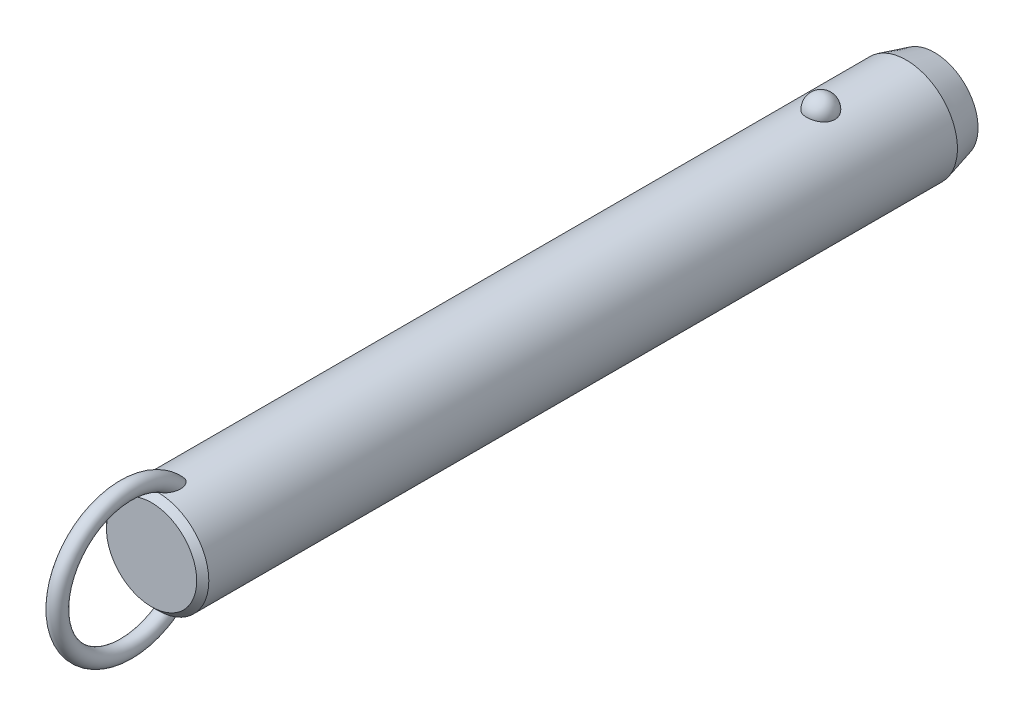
ISO-10303-21;
HEADER;
FILE_DESCRIPTION(('STEP AP214'),'2;1');
FILE_NAME('part.step','',(''),(''),'','','');
FILE_SCHEMA(('AUTOMOTIVE_DESIGN { 1 0 10303 214 1 1 1 1 }'));
ENDSEC;
DATA;
#1=APPLICATION_CONTEXT('core data for automotive mechanical design processes');
#2=APPLICATION_PROTOCOL_DEFINITION('international standard','automotive_design',2000,#1);
#3=PRODUCT_CONTEXT('',#1,'mechanical');
#4=PRODUCT('Part','Part','',(#3));
#5=PRODUCT_RELATED_PRODUCT_CATEGORY('part','',(#4));
#6=PRODUCT_DEFINITION_FORMATION('','',#4);
#7=PRODUCT_DEFINITION_CONTEXT('part definition',#1,'design');
#8=PRODUCT_DEFINITION('design','',#6,#7);
#9=PRODUCT_DEFINITION_SHAPE('','',#8);
#10=(LENGTH_UNIT() NAMED_UNIT(*) SI_UNIT(.MILLI.,.METRE.));
#11=(NAMED_UNIT(*) PLANE_ANGLE_UNIT() SI_UNIT($,.RADIAN.));
#12=(NAMED_UNIT(*) SI_UNIT($,.STERADIAN.) SOLID_ANGLE_UNIT());
#13=UNCERTAINTY_MEASURE_WITH_UNIT(LENGTH_MEASURE(1.E-05),#10,'distance_accuracy_value','');
#14=(GEOMETRIC_REPRESENTATION_CONTEXT(3) GLOBAL_UNCERTAINTY_ASSIGNED_CONTEXT((#13)) GLOBAL_UNIT_ASSIGNED_CONTEXT((#10,
#11,#12)) REPRESENTATION_CONTEXT('',''));
#15=CARTESIAN_POINT('',(0.,0.,0.));
#16=DIRECTION('',(0.,0.,1.));
#17=DIRECTION('',(1.,0.,0.));
#18=AXIS2_PLACEMENT_3D('',#15,#16,#17);
#19=CARTESIAN_POINT('',(0.,0.,149.9));
#20=DIRECTION('',(0.,0.,-1.));
#21=DIRECTION('',(-1.,0.,0.));
#22=AXIS2_PLACEMENT_3D('',#19,#20,#21);
#23=CYLINDRICAL_SURFACE('',#22,12.7);
#24=CARTESIAN_POINT('',(3.46661256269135,12.2177165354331,-3.49999999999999));
#25=CARTESIAN_POINT('',(3.4666090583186,12.2177194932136,-3.30432790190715));
#26=CARTESIAN_POINT('',(3.45063567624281,12.2222841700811,-3.10861112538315));
#27=CARTESIAN_POINT('',(3.38712451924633,12.2400345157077,-2.72271899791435));
#28=CARTESIAN_POINT('',(3.33957415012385,12.2532236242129,-2.53254588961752));
#29=CARTESIAN_POINT('',(3.2141234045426,12.286724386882,-2.16324948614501));
#30=CARTESIAN_POINT('',(3.13623639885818,12.3070329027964,-1.98412136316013));
#31=CARTESIAN_POINT('',(2.95205930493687,12.3525018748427,-1.64180592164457));
#32=CARTESIAN_POINT('',(2.84577003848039,12.3776621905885,-1.47861814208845));
#33=CARTESIAN_POINT('',(2.60688050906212,12.4301712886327,-1.17190583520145));
#34=CARTESIAN_POINT('',(2.47415697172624,12.4575299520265,-1.02847897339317));
#35=CARTESIAN_POINT('',(2.18615174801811,12.5112810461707,-0.766177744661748));
#36=CARTESIAN_POINT('',(2.03087002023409,12.5376734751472,-0.647303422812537));
#37=CARTESIAN_POINT('',(1.70237334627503,12.5864761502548,-0.437732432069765));
#38=CARTESIAN_POINT('',(1.52920948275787,12.6088972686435,-0.346958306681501));
#39=CARTESIAN_POINT('',(1.16944170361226,12.6473352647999,-0.195750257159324));
#40=CARTESIAN_POINT('',(0.982839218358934,12.663352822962,-0.135313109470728));
#41=CARTESIAN_POINT('',(0.604961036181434,12.6869706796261,-0.0473241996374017));
#42=CARTESIAN_POINT('',(0.41382314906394,12.6947125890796,-0.019218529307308));
#43=CARTESIAN_POINT('',(0.0293827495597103,12.7014203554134,0.00517254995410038));
#44=CARTESIAN_POINT('',(-0.163919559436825,12.7003870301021,0.001460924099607));
#45=CARTESIAN_POINT('',(-0.544374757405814,12.689735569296,-0.0373939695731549));
#46=CARTESIAN_POINT('',(-0.731575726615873,12.6802364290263,-0.0721015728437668));
#47=CARTESIAN_POINT('',(-1.09733277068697,12.6538333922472,-0.171364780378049));
#48=CARTESIAN_POINT('',(-1.27588869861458,12.6369293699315,-0.235920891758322));
#49=CARTESIAN_POINT('',(-1.6204698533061,12.5973946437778,-0.393548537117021));
#50=CARTESIAN_POINT('',(-1.78641865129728,12.5747321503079,-0.486778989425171));
#51=CARTESIAN_POINT('',(-2.10030671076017,12.5261316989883,-0.699110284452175));
#52=CARTESIAN_POINT('',(-2.24824419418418,12.5001934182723,-0.818213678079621));
#53=CARTESIAN_POINT('',(-2.52491489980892,12.4472906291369,-1.08157124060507));
#54=CARTESIAN_POINT('',(-2.65324222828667,12.4203160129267,-1.22624992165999));
#55=CARTESIAN_POINT('',(-2.88410007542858,12.3687509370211,-1.53528325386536));
#56=CARTESIAN_POINT('',(-2.98662883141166,12.3441606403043,-1.69963924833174));
#57=CARTESIAN_POINT('',(-3.16432417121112,12.2998199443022,-2.04548497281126));
#58=CARTESIAN_POINT('',(-3.23917525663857,12.2801261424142,-2.22714424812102));
#59=CARTESIAN_POINT('',(-3.35800573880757,12.248167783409,-2.60091389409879));
#60=CARTESIAN_POINT('',(-3.4019860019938,12.2359030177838,-2.79302397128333));
#61=CARTESIAN_POINT('',(-3.45784812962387,12.2202347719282,-3.18140279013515));
#62=CARTESIAN_POINT('',(-3.46986123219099,12.2167950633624,-3.37765118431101));
#63=CARTESIAN_POINT('',(-3.46186273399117,12.2190638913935,-3.76943689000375));
#64=CARTESIAN_POINT('',(-3.44185196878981,12.2247721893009,-3.96497421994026));
#65=CARTESIAN_POINT('',(-3.37048652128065,12.2446381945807,-4.348817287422));
#66=CARTESIAN_POINT('',(-3.31928253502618,12.2587552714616,-4.53715319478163));
#67=CARTESIAN_POINT('',(-3.18693461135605,12.2938237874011,-4.90231727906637));
#68=CARTESIAN_POINT('',(-3.1057895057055,12.3147754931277,-5.07914500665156));
#69=CARTESIAN_POINT('',(-2.91506431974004,12.3613125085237,-5.4173205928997));
#70=CARTESIAN_POINT('',(-2.80533587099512,12.3869217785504,-5.57858147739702));
#71=CARTESIAN_POINT('',(-2.560414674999,12.4398525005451,-5.88013283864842));
#72=CARTESIAN_POINT('',(-2.42522099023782,12.4671740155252,-6.0204225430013));
#73=CARTESIAN_POINT('',(-2.1323357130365,12.5205965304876,-6.27662798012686));
#74=CARTESIAN_POINT('',(-1.97456596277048,12.5466928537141,-6.39245542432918));
#75=CARTESIAN_POINT('',(-1.64115839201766,12.5946384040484,-6.59583547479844));
#76=CARTESIAN_POINT('',(-1.46552179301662,12.6164879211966,-6.68339001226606));
#77=CARTESIAN_POINT('',(-1.10356050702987,12.6532533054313,-6.82682153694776));
#78=CARTESIAN_POINT('',(-0.9173913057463,12.6682500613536,-6.88306988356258));
#79=CARTESIAN_POINT('',(-0.537836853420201,12.6900288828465,-6.96386887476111));
#80=CARTESIAN_POINT('',(-0.344452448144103,12.6968119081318,-6.98842322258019));
#81=CARTESIAN_POINT('',(0.0402577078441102,12.7013667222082,-7.0049646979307));
#82=CARTESIAN_POINT('',(0.231556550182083,12.6993008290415,-6.99753844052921));
#83=CARTESIAN_POINT('',(0.610105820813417,12.6867505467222,-6.95166366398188));
#84=CARTESIAN_POINT('',(0.797356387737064,12.6762664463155,-6.91321620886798));
#85=CARTESIAN_POINT('',(1.16186657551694,12.6480587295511,-6.80658431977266));
#86=CARTESIAN_POINT('',(1.33915951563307,12.6303611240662,-6.73850666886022));
#87=CARTESIAN_POINT('',(1.67968518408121,12.5896027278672,-6.57450875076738));
#88=CARTESIAN_POINT('',(1.84291705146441,12.5665416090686,-6.47858678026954));
#89=CARTESIAN_POINT('',(2.15340192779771,12.5171072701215,-6.25982455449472));
#90=CARTESIAN_POINT('',(2.30037831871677,12.4906895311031,-6.1366018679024));
#91=CARTESIAN_POINT('',(2.5717412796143,12.4376567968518,-5.86739587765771));
#92=CARTESIAN_POINT('',(2.69612388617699,12.4110417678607,-5.72140858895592));
#93=CARTESIAN_POINT('',(2.92107785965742,12.360051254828,-5.40794137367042));
#94=CARTESIAN_POINT('',(3.02121329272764,12.3357209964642,-5.24014110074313));
#95=CARTESIAN_POINT('',(3.19236291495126,12.2925446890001,-4.88969865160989));
#96=CARTESIAN_POINT('',(3.26338839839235,12.2736965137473,-4.70706226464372));
#97=CARTESIAN_POINT('',(3.36788038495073,12.245404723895,-4.3546951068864));
#98=CARTESIAN_POINT('',(3.40484026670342,12.2351018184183,-4.18605935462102));
#99=CARTESIAN_POINT('',(3.45420764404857,12.2212564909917,-3.84496058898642));
#100=CARTESIAN_POINT('',(3.46661565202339,12.2177139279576,-3.67249765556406));
#101=CARTESIAN_POINT('',(3.46661256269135,12.2177165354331,-3.49999999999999));
#102=B_SPLINE_CURVE_WITH_KNOTS('',3,(#24,#25,#26,#27,#28,#29,#30,#31,#32,#33,#34,#35,#36,#37,
#38,#39,#40,#41,#42,#43,#44,#45,#46,#47,#48,#49,#50,#51,#52,#53,#54,#55,#56,#57,#58,#59,#60,#61,
#62,#63,#64,#65,#66,#67,#68,#69,#70,#71,#72,#73,#74,#75,#76,#77,#78,#79,#80,#81,#82,#83,#84,#85,
#86,#87,#88,#89,#90,#91,#92,#93,#94,#95,#96,#97,#98,#99,#100,#101),.UNSPECIFIED.,.T.,.F.,(4,2,2,
2,2,2,2,2,2,2,2,2,2,2,2,2,2,2,2,2,2,2,2,2,2,2,2,2,2,2,2,2,2,2,2,2,2,2,4),(0.,0.586396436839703,
1.17302689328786,1.7593990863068,2.34575431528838,2.93491084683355,3.52406845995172,
4.11158733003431,4.69904375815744,5.2762784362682,5.85345931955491,6.42265312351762,
6.99185659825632,7.56427334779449,8.136746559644,8.71981013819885,9.3029135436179,
9.89247258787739,10.4820150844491,11.0691335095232,11.6562366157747,12.2405256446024,
12.8248374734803,13.412244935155,13.9996740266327,14.5891883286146,15.1786623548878,
15.7609861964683,16.3432419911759,16.9148635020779,17.4864654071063,18.0560241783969,
18.6256177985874,19.2037609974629,19.7820055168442,20.3699810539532,20.957728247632,
21.4746855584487,21.9916320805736),.UNSPECIFIED.);
#103=CARTESIAN_POINT('',(3.46661256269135,12.2177165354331,-3.49999999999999));
#104=VERTEX_POINT('',#103);
#105=EDGE_CURVE('E41',#104,#104,#102,.T.);
#106=ORIENTED_EDGE('',*,*,#105,.T.);
#107=EDGE_LOOP('',(#106));
#108=FACE_BOUND('',#107,.T.);
#109=CARTESIAN_POINT('',(0.,0.,161.1));
#110=DIRECTION('',(0.,0.,1.));
#111=DIRECTION('',(1.,0.,0.));
#112=AXIS2_PLACEMENT_3D('',#109,#110,#111);
#113=CIRCLE('',#112,12.7);
#114=CARTESIAN_POINT('',(12.7,0.,161.1));
#115=VERTEX_POINT('',#114);
#116=EDGE_CURVE('E10',#115,#115,#113,.F.);
#117=ORIENTED_EDGE('',*,*,#116,.T.);
#118=EDGE_LOOP('',(#117));
#119=FACE_BOUND('',#118,.T.);
#120=CARTESIAN_POINT('',(-0.548122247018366,-12.6881662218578,154.843218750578));
#121=CARTESIAN_POINT('',(-0.648865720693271,-12.6838128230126,154.877926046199));
#122=CARTESIAN_POINT('',(-0.746398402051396,-12.6783867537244,154.922042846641));
#123=CARTESIAN_POINT('',(-0.932125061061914,-12.666091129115,155.026764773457));
#124=CARTESIAN_POINT('',(-1.02030388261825,-12.6592192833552,155.087396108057));
#125=CARTESIAN_POINT('',(-1.18487740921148,-12.6448747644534,155.221847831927));
#126=CARTESIAN_POINT('',(-1.26134296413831,-12.637406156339,155.295582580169));
#127=CARTESIAN_POINT('',(-1.4023120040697,-12.6225412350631,155.453604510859));
#128=CARTESIAN_POINT('',(-1.466814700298,-12.6151449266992,155.53789238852));
#129=CARTESIAN_POINT('',(-1.60714786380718,-12.5981718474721,155.749657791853));
#130=CARTESIAN_POINT('',(-1.67725126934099,-12.588900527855,155.880962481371));
#131=CARTESIAN_POINT('',(-1.79536591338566,-12.5725964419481,156.153247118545));
#132=CARTESIAN_POINT('',(-1.84333535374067,-12.5655679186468,156.294244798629));
#133=CARTESIAN_POINT('',(-1.93422576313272,-12.5519624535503,156.637645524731));
#134=CARTESIAN_POINT('',(-1.96788773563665,-12.5466298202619,156.842557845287));
#135=CARTESIAN_POINT('',(-1.9941399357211,-12.542463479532,157.151760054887));
#136=CARTESIAN_POINT('',(-1.99883864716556,-12.5417153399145,157.255298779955));
#137=CARTESIAN_POINT('',(-2.00078003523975,-12.5414074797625,157.46245124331));
#138=CARTESIAN_POINT('',(-1.99802449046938,-12.5418474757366,157.566064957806));
#139=CARTESIAN_POINT('',(-1.98336733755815,-12.5441750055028,157.81032076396));
#140=CARTESIAN_POINT('',(-1.96851430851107,-12.5465291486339,157.950780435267));
#141=CARTESIAN_POINT('',(-1.92707089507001,-12.5529612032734,158.229960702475));
#142=CARTESIAN_POINT('',(-1.90047458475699,-12.5570399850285,158.368680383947));
#143=CARTESIAN_POINT('',(-1.83619120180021,-12.5666008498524,158.64341135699));
#144=CARTESIAN_POINT('',(-1.79850828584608,-12.57208240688,158.779423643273));
#145=CARTESIAN_POINT('',(-1.71223796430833,-12.5841228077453,159.047842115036));
#146=CARTESIAN_POINT('',(-1.66365679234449,-12.5906810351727,159.180250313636));
#147=CARTESIAN_POINT('',(-1.57804503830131,-12.6016176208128,159.38548877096));
#148=CARTESIAN_POINT('',(-1.54477252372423,-12.6057501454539,159.459914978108));
#149=CARTESIAN_POINT('',(-1.47424480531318,-12.6141930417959,159.606839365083));
#150=CARTESIAN_POINT('',(-1.43699041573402,-12.6185033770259,159.679337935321));
#151=CARTESIAN_POINT('',(-1.35825795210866,-12.6272207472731,159.821892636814));
#152=CARTESIAN_POINT('',(-1.31678520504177,-12.6316276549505,159.891951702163));
#153=CARTESIAN_POINT('',(-1.22917793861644,-12.6404532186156,160.029070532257));
#154=CARTESIAN_POINT('',(-1.18304514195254,-12.6448718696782,160.096131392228));
#155=CARTESIAN_POINT('',(-1.07246411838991,-12.6547893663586,160.243874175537));
#156=CARTESIAN_POINT('',(-1.0064223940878,-12.6602600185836,160.323384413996));
#157=CARTESIAN_POINT('',(-0.864441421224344,-12.6707460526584,160.473169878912));
#158=CARTESIAN_POINT('',(-0.788516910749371,-12.6757620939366,160.543458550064));
#159=CARTESIAN_POINT('',(-0.652215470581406,-12.6833591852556,160.648680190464));
#160=CARTESIAN_POINT('',(-0.594982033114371,-12.6861973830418,160.687624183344));
#161=CARTESIAN_POINT('',(-0.475269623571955,-12.6912445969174,160.756489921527));
#162=CARTESIAN_POINT('',(-0.412800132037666,-12.6934547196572,160.786427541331));
#163=CARTESIAN_POINT('',(-0.295749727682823,-12.6966636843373,160.829756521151));
#164=CARTESIAN_POINT('',(-0.241949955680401,-12.6978134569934,160.845218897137));
#165=CARTESIAN_POINT('',(-0.132508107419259,-12.6994261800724,160.866884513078));
#166=CARTESIAN_POINT('',(-0.0768679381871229,-12.6998898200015,160.873097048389));
#167=CARTESIAN_POINT('',(0.0347696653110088,-12.7000752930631,160.875583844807));
#168=CARTESIAN_POINT('',(0.0907676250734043,-12.6997954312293,160.871835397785));
#169=CARTESIAN_POINT('',(0.201283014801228,-12.6985255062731,160.854788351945));
#170=CARTESIAN_POINT('',(0.255799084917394,-12.6975348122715,160.841481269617));
#171=CARTESIAN_POINT('',(0.376042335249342,-12.6946091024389,160.80203792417));
#172=CARTESIAN_POINT('',(0.440950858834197,-12.6924943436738,160.773449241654));
#173=CARTESIAN_POINT('',(0.56535027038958,-12.6875639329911,160.706323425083));
#174=CARTESIAN_POINT('',(0.624828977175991,-12.6847467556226,160.667764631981));
#175=CARTESIAN_POINT('',(0.774116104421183,-12.6767252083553,160.556949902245));
#176=CARTESIAN_POINT('',(0.859449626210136,-12.6711344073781,160.478760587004));
#177=CARTESIAN_POINT('',(1.01789440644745,-12.6593922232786,160.310943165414));
#178=CARTESIAN_POINT('',(1.09096902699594,-12.653239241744,160.221282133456));
#179=CARTESIAN_POINT('',(1.22268793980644,-12.6411674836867,160.040265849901));
#180=CARTESIAN_POINT('',(1.28193986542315,-12.6352572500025,159.949345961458));
#181=CARTESIAN_POINT('',(1.39259777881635,-12.6235401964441,159.762792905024));
#182=CARTESIAN_POINT('',(1.44399707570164,-12.6177334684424,159.667155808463));
#183=CARTESIAN_POINT('',(1.53972870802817,-12.6064093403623,159.472273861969));
#184=CARTESIAN_POINT('',(1.58405262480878,-12.6008922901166,159.373024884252));
#185=CARTESIAN_POINT('',(1.66600705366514,-12.5903187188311,159.171772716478));
#186=CARTESIAN_POINT('',(1.70363651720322,-12.5852622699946,159.069769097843));
#187=CARTESIAN_POINT('',(1.77545379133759,-12.5753406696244,158.854358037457));
#188=CARTESIAN_POINT('',(1.80903453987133,-12.5705328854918,158.740745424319));
#189=CARTESIAN_POINT('',(1.86844163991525,-12.5618400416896,158.511457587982));
#190=CARTESIAN_POINT('',(1.89426665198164,-12.5579551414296,158.395782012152));
#191=CARTESIAN_POINT('',(1.93785464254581,-12.5513030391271,158.163007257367));
#192=CARTESIAN_POINT('',(1.95562640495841,-12.5485346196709,158.045909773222));
#193=CARTESIAN_POINT('',(1.98264463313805,-12.5442934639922,157.810747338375));
#194=CARTESIAN_POINT('',(1.99189298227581,-12.5428204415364,157.69268260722));
#195=CARTESIAN_POINT('',(2.00416068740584,-12.540871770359,157.380622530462));
#196=CARTESIAN_POINT('',(1.99944433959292,-12.541631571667,157.186229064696));
#197=CARTESIAN_POINT('',(1.96113755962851,-12.5476846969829,156.800309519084));
#198=CARTESIAN_POINT('',(1.92758341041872,-12.5529723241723,156.608780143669));
#199=CARTESIAN_POINT('',(1.83934342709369,-12.5661532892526,156.282272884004));
#200=CARTESIAN_POINT('',(1.79215440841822,-12.5730485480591,156.14524997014));
#201=CARTESIAN_POINT('',(1.67676242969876,-12.588958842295,155.880445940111));
#202=CARTESIAN_POINT('',(1.60859050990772,-12.597970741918,155.752651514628));
#203=CARTESIAN_POINT('',(1.4658383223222,-12.6152829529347,155.535800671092));
#204=CARTESIAN_POINT('',(1.39525727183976,-12.6233659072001,155.44410500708));
#205=CARTESIAN_POINT('',(1.23992594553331,-12.6395676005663,155.273485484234));
#206=CARTESIAN_POINT('',(1.1551793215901,-12.6476863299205,155.194558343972));
#207=CARTESIAN_POINT('',(0.971995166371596,-12.6630846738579,155.052643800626));
#208=CARTESIAN_POINT('',(0.873456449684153,-12.6703572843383,154.989784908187));
#209=CARTESIAN_POINT('',(0.665847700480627,-12.6829569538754,154.884487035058));
#210=CARTESIAN_POINT('',(0.556784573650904,-12.688285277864,154.842034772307));
#211=CARTESIAN_POINT('',(0.347338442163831,-12.6956226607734,154.784443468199));
#212=CARTESIAN_POINT('',(0.247759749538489,-12.6979816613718,154.766399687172));
#213=CARTESIAN_POINT('',(0.047021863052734,-12.7003077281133,154.748600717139));
#214=CARTESIAN_POINT('',(-0.0541350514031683,-12.7002779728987,154.748821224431));
#215=CARTESIAN_POINT('',(-0.221414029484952,-12.6982482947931,154.764363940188));
#216=CARTESIAN_POINT('',(-0.288055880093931,-12.6969033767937,154.774666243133));
#217=CARTESIAN_POINT('',(-0.419599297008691,-12.6932369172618,154.80313489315));
#218=CARTESIAN_POINT('',(-0.484501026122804,-12.6909154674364,154.821300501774));
#219=CARTESIAN_POINT('',(-0.548122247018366,-12.6881662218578,154.843218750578));
#220=B_SPLINE_CURVE_WITH_KNOTS('',3,(#120,#121,#122,#123,#124,#125,#126,#127,#128,#129,#130,
#131,#132,#133,#134,#135,#136,#137,#138,#139,#140,#141,#142,#143,#144,#145,#146,#147,#148,#149,
#150,#151,#152,#153,#154,#155,#156,#157,#158,#159,#160,#161,#162,#163,#164,#165,#166,#167,#168,
#169,#170,#171,#172,#173,#174,#175,#176,#177,#178,#179,#180,#181,#182,#183,#184,#185,#186,#187,
#188,#189,#190,#191,#192,#193,#194,#195,#196,#197,#198,#199,#200,#201,#202,#203,#204,#205,#206,
#207,#208,#209,#210,#211,#212,#213,#214,#215,#216,#217,#218,#219),.UNSPECIFIED.,.T.,.F.,(4,2,2,
2,2,2,2,2,2,2,2,2,2,2,2,2,2,2,2,2,2,2,2,2,2,2,2,2,2,2,2,2,2,2,2,2,2,2,2,2,2,2,2,2,2,2,2,2,2,4),
(0.,0.31964225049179,0.639794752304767,0.957927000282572,1.27608021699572,1.72100165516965,
2.16675988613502,2.78630021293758,3.09705782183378,3.40774128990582,3.83096358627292,
4.25439969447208,4.67767724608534,5.1007133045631,5.34550297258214,5.59024267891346,
5.83467707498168,6.07902143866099,6.38891080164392,6.69834321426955,6.90560910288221,
7.11250749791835,7.27977315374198,7.44687060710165,7.61434932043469,7.78197685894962,
7.99365544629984,8.20579780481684,8.55147335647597,8.89816429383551,9.22375138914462,
9.54961437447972,9.87586224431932,10.202161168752,10.5575872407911,10.9130746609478,
11.2681734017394,11.6231936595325,12.2046601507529,12.7853961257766,13.219164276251,
13.6522938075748,13.9989174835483,14.3454519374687,14.6946768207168,15.0436740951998,
15.3457513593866,15.6474266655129,15.8493051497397,16.0511646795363),.UNSPECIFIED.);
#221=CARTESIAN_POINT('',(-0.548122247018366,-12.6881662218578,154.843218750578));
#222=VERTEX_POINT('',#221);
#223=EDGE_CURVE('E60',#222,#222,#220,.T.);
#224=ORIENTED_EDGE('',*,*,#223,.T.);
#225=EDGE_LOOP('',(#224));
#226=FACE_BOUND('',#225,.T.);
#227=CARTESIAN_POINT('',(-0.548122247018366,12.6881662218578,154.843218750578));
#228=CARTESIAN_POINT('',(-0.459436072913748,12.6919968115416,154.812673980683));
#229=CARTESIAN_POINT('',(-0.368189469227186,12.6949996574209,154.789391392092));
#230=CARTESIAN_POINT('',(-0.183024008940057,12.6990186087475,154.758406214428));
#231=CARTESIAN_POINT('',(-0.089104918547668,12.7000345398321,154.750704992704));
#232=CARTESIAN_POINT('',(0.0987147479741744,12.6999636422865,154.751245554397));
#233=CARTESIAN_POINT('',(0.192615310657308,12.6988761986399,154.759492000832));
#234=CARTESIAN_POINT('',(0.377658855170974,12.6947211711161,154.791551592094));
#235=CARTESIAN_POINT('',(0.468801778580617,12.6916535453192,154.815365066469));
#236=CARTESIAN_POINT('',(0.645809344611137,12.6838788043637,154.87745651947));
#237=CARTESIAN_POINT('',(0.731679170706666,12.6791733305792,154.915720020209));
#238=CARTESIAN_POINT('',(0.896315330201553,12.6686004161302,155.005120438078));
#239=CARTESIAN_POINT('',(0.97508059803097,12.6627328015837,155.056259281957));
#240=CARTESIAN_POINT('',(1.12963655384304,12.6499161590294,155.17367820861));
#241=CARTESIAN_POINT('',(1.20478673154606,12.6429194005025,155.240792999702));
#242=CARTESIAN_POINT('',(1.34448241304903,12.6288282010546,155.38522507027));
#243=CARTESIAN_POINT('',(1.40902173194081,12.621733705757,155.462548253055));
#244=CARTESIAN_POINT('',(1.55208211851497,12.6050877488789,155.659247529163));
#245=CARTESIAN_POINT('',(1.62510490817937,12.5957546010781,155.782654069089));
#246=CARTESIAN_POINT('',(1.7501904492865,12.5789823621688,156.039769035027));
#247=CARTESIAN_POINT('',(1.8022137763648,12.5715468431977,156.173496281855));
#248=CARTESIAN_POINT('',(1.90309965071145,12.5567434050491,156.498351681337));
#249=CARTESIAN_POINT('',(1.94342317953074,12.5504515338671,156.692161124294));
#250=CARTESIAN_POINT('',(1.99332997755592,12.5426147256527,157.08378810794));
#251=CARTESIAN_POINT('',(2.00285305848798,12.5410790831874,157.281612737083));
#252=CARTESIAN_POINT('',(1.99678999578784,12.5420407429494,157.616642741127));
#253=CARTESIAN_POINT('',(1.98794117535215,12.5434564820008,157.754042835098));
#254=CARTESIAN_POINT('',(1.95865119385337,12.5480641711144,158.027639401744));
#255=CARTESIAN_POINT('',(1.93820436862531,12.5512569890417,158.163835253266));
#256=CARTESIAN_POINT('',(1.88647896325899,12.5591352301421,158.434249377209));
#257=CARTESIAN_POINT('',(1.85518800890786,12.5638223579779,158.568465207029));
#258=CARTESIAN_POINT('',(1.78217886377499,12.5743868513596,158.833936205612));
#259=CARTESIAN_POINT('',(1.74046509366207,12.5802637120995,158.965192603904));
#260=CARTESIAN_POINT('',(1.66024095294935,12.5910571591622,159.186085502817));
#261=CARTESIAN_POINT('',(1.62434772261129,12.5957535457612,159.276690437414));
#262=CARTESIAN_POINT('',(1.54709009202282,12.6054762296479,159.455512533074));
#263=CARTESIAN_POINT('',(1.50572681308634,12.6105024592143,159.543730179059));
#264=CARTESIAN_POINT('',(1.41728020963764,12.620748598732,159.716932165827));
#265=CARTESIAN_POINT('',(1.37021377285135,12.625967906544,159.801925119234));
#266=CARTESIAN_POINT('',(1.26969620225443,12.6364721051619,159.968007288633));
#267=CARTESIAN_POINT('',(1.21624929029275,12.6417569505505,160.049099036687));
#268=CARTESIAN_POINT('',(1.1030441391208,12.6521331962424,160.204702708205));
#269=CARTESIAN_POINT('',(1.04340936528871,12.657226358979,160.279303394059));
#270=CARTESIAN_POINT('',(0.915919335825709,12.667090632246,160.421324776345));
#271=CARTESIAN_POINT('',(0.848064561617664,12.6718617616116,160.48874589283));
#272=CARTESIAN_POINT('',(0.717035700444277,12.67987711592,160.600624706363));
#273=CARTESIAN_POINT('',(0.655526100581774,12.6832377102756,160.646997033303));
#274=CARTESIAN_POINT('',(0.525985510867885,12.6892676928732,160.729619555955));
#275=CARTESIAN_POINT('',(0.457969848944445,12.6919386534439,160.765892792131));
#276=CARTESIAN_POINT('',(0.334859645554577,12.695691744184,160.816657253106));
#277=CARTESIAN_POINT('',(0.281116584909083,12.6970073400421,160.834373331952));
#278=CARTESIAN_POINT('',(0.171425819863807,12.6989609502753,160.860642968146));
#279=CARTESIAN_POINT('',(0.115480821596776,12.699599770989,160.869207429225));
#280=CARTESIAN_POINT('',(0.00272618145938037,12.7001251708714,160.876253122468));
#281=CARTESIAN_POINT('',(-0.0540859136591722,12.7000089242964,160.874696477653));
#282=CARTESIAN_POINT('',(-0.16654462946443,12.6990328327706,160.861600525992));
#283=CARTESIAN_POINT('',(-0.222190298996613,12.6981724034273,160.850053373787));
#284=CARTESIAN_POINT('',(-0.342018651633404,12.695562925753,160.814912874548));
#285=CARTESIAN_POINT('',(-0.405606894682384,12.6936676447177,160.78933225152));
#286=CARTESIAN_POINT('',(-0.527815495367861,12.6891754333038,160.728311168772));
#287=CARTESIAN_POINT('',(-0.586425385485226,12.6865770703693,160.692850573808));
#288=CARTESIAN_POINT('',(-0.731842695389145,12.6792129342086,160.591496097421));
#289=CARTESIAN_POINT('',(-0.81470941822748,12.6740767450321,160.5200395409));
#290=CARTESIAN_POINT('',(-0.969101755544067,12.6632083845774,160.36589007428));
#291=CARTESIAN_POINT('',(-1.04059564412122,12.6574746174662,160.283166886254));
#292=CARTESIAN_POINT('',(-1.16981116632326,12.6461638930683,160.115809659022));
#293=CARTESIAN_POINT('',(-1.22811369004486,12.6405994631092,160.031616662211));
#294=CARTESIAN_POINT('',(-1.33743405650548,12.6295007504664,159.858579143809));
#295=CARTESIAN_POINT('',(-1.38844577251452,12.6239664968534,159.769730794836));
#296=CARTESIAN_POINT('',(-1.48400702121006,12.6130898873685,159.588389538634));
#297=CARTESIAN_POINT('',(-1.52854232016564,12.6077479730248,159.495889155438));
#298=CARTESIAN_POINT('',(-1.61150113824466,12.5974127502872,159.308160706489));
#299=CARTESIAN_POINT('',(-1.64992317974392,12.5924195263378,159.212931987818));
#300=CARTESIAN_POINT('',(-1.73468589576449,12.581070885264,158.98289362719));
#301=CARTESIAN_POINT('',(-1.77831261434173,12.5749388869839,158.847066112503));
#302=CARTESIAN_POINT('',(-1.85439734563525,12.5639437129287,158.572212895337));
#303=CARTESIAN_POINT('',(-1.88684994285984,12.5590811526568,158.433185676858));
#304=CARTESIAN_POINT('',(-1.94008483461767,12.550968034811,158.15309235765));
#305=CARTESIAN_POINT('',(-1.96088706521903,12.5477147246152,158.012030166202));
#306=CARTESIAN_POINT('',(-1.99000539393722,12.5431291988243,157.728668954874));
#307=CARTESIAN_POINT('',(-1.99832911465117,12.5417958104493,157.586370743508));
#308=CARTESIAN_POINT('',(-2.00166624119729,12.5412674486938,157.257627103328));
#309=CARTESIAN_POINT('',(-1.99178843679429,12.5428579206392,157.071088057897));
#310=CARTESIAN_POINT('',(-1.94455183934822,12.5502731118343,156.70162404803));
#311=CARTESIAN_POINT('',(-1.90724032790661,12.5560905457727,156.518693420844));
#312=CARTESIAN_POINT('',(-1.81330718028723,12.5699462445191,156.204848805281));
#313=CARTESIAN_POINT('',(-1.76338820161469,12.5771273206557,156.071910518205));
#314=CARTESIAN_POINT('',(-1.64305018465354,12.593414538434,155.815681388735));
#315=CARTESIAN_POINT('',(-1.57265346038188,12.6025185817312,155.692380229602));
#316=CARTESIAN_POINT('',(-1.42634956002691,12.6198178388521,155.483564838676));
#317=CARTESIAN_POINT('',(-1.35423772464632,12.6278405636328,155.395384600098));
#318=CARTESIAN_POINT('',(-1.19645664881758,12.6437632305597,155.232107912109));
#319=CARTESIAN_POINT('',(-1.1108053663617,12.6516633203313,155.156994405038));
#320=CARTESIAN_POINT('',(-0.947219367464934,12.6648319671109,155.037811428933));
#321=CARTESIAN_POINT('',(-0.871624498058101,12.670300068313,154.990541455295));
#322=CARTESIAN_POINT('',(-0.714161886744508,12.6801492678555,154.9077413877));
#323=CARTESIAN_POINT('',(-0.632295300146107,12.684530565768,154.87220913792));
#324=CARTESIAN_POINT('',(-0.548122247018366,12.6881662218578,154.843218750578));
#325=B_SPLINE_CURVE_WITH_KNOTS('',3,(#227,#228,#229,#230,#231,#232,#233,#234,#235,#236,#237,
#238,#239,#240,#241,#242,#243,#244,#245,#246,#247,#248,#249,#250,#251,#252,#253,#254,#255,#256,
#257,#258,#259,#260,#261,#262,#263,#264,#265,#266,#267,#268,#269,#270,#271,#272,#273,#274,#275,
#276,#277,#278,#279,#280,#281,#282,#283,#284,#285,#286,#287,#288,#289,#290,#291,#292,#293,#294,
#295,#296,#297,#298,#299,#300,#301,#302,#303,#304,#305,#306,#307,#308,#309,#310,#311,#312,#313,
#314,#315,#316,#317,#318,#319,#320,#321,#322,#323,#324),.UNSPECIFIED.,.T.,.F.,(4,2,2,2,2,2,2,2,
2,2,2,2,2,2,2,2,2,2,2,2,2,2,2,2,2,2,2,2,2,2,2,2,2,2,2,2,2,2,2,2,2,2,2,2,2,2,2,2,4),(0.,
0.281328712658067,0.562682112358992,0.844117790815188,1.12555942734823,1.40671982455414,
1.68792232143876,1.98972294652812,2.29169886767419,2.72039860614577,3.14989948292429,
3.74084916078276,4.33295293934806,4.74554109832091,5.15833092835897,5.57159335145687,
5.98468079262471,6.27722775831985,6.56971484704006,6.8613560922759,7.15280542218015,
7.43927407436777,7.72572595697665,7.95635862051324,8.18646071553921,8.35559393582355,
8.52452541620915,8.69408946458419,8.86378678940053,9.06834348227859,9.27332014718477,
9.60010414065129,9.92778432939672,10.2350252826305,10.5425229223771,10.8506864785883,
11.15892440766,11.5867893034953,12.0148612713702,12.4421984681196,12.8692745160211,
13.4279365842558,13.9856380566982,14.4107062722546,14.835313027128,15.1765567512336,
15.517351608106,15.7844129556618,16.051425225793),.UNSPECIFIED.);
#326=CARTESIAN_POINT('',(-0.548122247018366,12.6881662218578,154.843218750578));
#327=VERTEX_POINT('',#326);
#328=EDGE_CURVE('E67',#327,#327,#325,.T.);
#329=ORIENTED_EDGE('',*,*,#328,.T.);
#330=EDGE_LOOP('',(#329));
#331=FACE_BOUND('',#330,.T.);
#332=CARTESIAN_POINT('',(0.,0.,-24.6999999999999));
#333=DIRECTION('',(0.,0.,-1.));
#334=DIRECTION('',(-1.,0.,0.));
#335=AXIS2_PLACEMENT_3D('',#332,#333,#334);
#336=CIRCLE('',#335,12.7);
#337=CARTESIAN_POINT('',(-12.7,0.,-24.6999999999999));
#338=VERTEX_POINT('',#337);
#339=EDGE_CURVE('E57',#338,#338,#336,.F.);
#340=ORIENTED_EDGE('',*,*,#339,.T.);
#341=EDGE_LOOP('',(#340));
#342=FACE_BOUND('',#341,.T.);
#343=ADVANCED_FACE('F37',(#108,#119,#226,#331,#342),#23,.T.);
#344=CARTESIAN_POINT('',(0.,0.,-31.7));
#345=DIRECTION('',(0.,0.,-1.));
#346=DIRECTION('',(-1.,0.,0.));
#347=AXIS2_PLACEMENT_3D('',#344,#345,#346);
#348=PLANE('',#347);
#349=CARTESIAN_POINT('',(0.,0.,-31.7));
#350=DIRECTION('',(0.,0.,-1.));
#351=DIRECTION('',(-1.,0.,0.));
#352=AXIS2_PLACEMENT_3D('',#349,#350,#351);
#353=CIRCLE('',#352,10.8243556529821);
#354=CARTESIAN_POINT('',(-10.8243556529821,0.,-31.7));
#355=VERTEX_POINT('',#354);
#356=EDGE_CURVE('E66',#355,#355,#353,.T.);
#357=ORIENTED_EDGE('',*,*,#356,.T.);
#358=EDGE_LOOP('',(#357));
#359=FACE_BOUND('',#358,.T.);
#360=ADVANCED_FACE('F85',(#359),#348,.T.);
#361=CARTESIAN_POINT('',(0.,0.,-31.7));
#362=DIRECTION('',(0.,0.,1.));
#363=DIRECTION('',(1.,0.,0.));
#364=AXIS2_PLACEMENT_3D('',#361,#362,#363);
#365=CONICAL_SURFACE('',#364,10.8243556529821,0.261799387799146);
#366=ORIENTED_EDGE('',*,*,#339,.F.);
#367=EDGE_LOOP('',(#366));
#368=FACE_BOUND('',#367,.T.);
#369=ORIENTED_EDGE('',*,*,#356,.F.);
#370=EDGE_LOOP('',(#369));
#371=FACE_BOUND('',#370,.T.);
#372=ADVANCED_FACE('F83',(#368,#371),#365,.T.);
#373=CARTESIAN_POINT('',(0.,0.,162.6));
#374=DIRECTION('',(0.,0.,1.));
#375=DIRECTION('',(1.,0.,0.));
#376=AXIS2_PLACEMENT_3D('',#373,#374,#375);
#377=PLANE('',#376);
#378=CARTESIAN_POINT('',(0.,0.,162.6));
#379=DIRECTION('',(0.,0.,1.));
#380=DIRECTION('',(1.,0.,0.));
#381=AXIS2_PLACEMENT_3D('',#378,#379,#380);
#382=CIRCLE('',#381,11.2);
#383=CARTESIAN_POINT('',(11.2,0.,162.6));
#384=VERTEX_POINT('',#383);
#385=EDGE_CURVE('E50',#384,#384,#382,.T.);
#386=ORIENTED_EDGE('',*,*,#385,.T.);
#387=EDGE_LOOP('',(#386));
#388=FACE_BOUND('',#387,.T.);
#389=ADVANCED_FACE('F77',(#388),#377,.T.);
#390=CARTESIAN_POINT('',(0.,0.,168.95));
#391=DIRECTION('',(1.,0.,0.));
#392=DIRECTION('',(0.,0.,-1.));
#393=AXIS2_PLACEMENT_3D('',#390,#391,#392);
#394=TOROIDAL_SURFACE('',#393,17.05,2.);
#395=ORIENTED_EDGE('',*,*,#328,.F.);
#396=EDGE_LOOP('',(#395));
#397=FACE_BOUND('',#396,.T.);
#398=ORIENTED_EDGE('',*,*,#223,.F.);
#399=EDGE_LOOP('',(#398));
#400=FACE_BOUND('',#399,.T.);
#401=ADVANCED_FACE('F73',(#397,#400),#394,.T.);
#402=CARTESIAN_POINT('',(0.,0.,162.6));
#403=DIRECTION('',(0.,0.,-1.));
#404=DIRECTION('',(-1.,0.,0.));
#405=AXIS2_PLACEMENT_3D('',#402,#403,#404);
#406=CONICAL_SURFACE('',#405,11.2,0.785398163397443);
#407=ORIENTED_EDGE('',*,*,#116,.F.);
#408=EDGE_LOOP('',(#407));
#409=FACE_BOUND('',#408,.T.);
#410=ORIENTED_EDGE('',*,*,#385,.F.);
#411=EDGE_LOOP('',(#410));
#412=FACE_BOUND('',#411,.T.);
#413=ADVANCED_FACE('F39',(#409,#412),#406,.T.);
#414=CARTESIAN_POINT('',(0.,12.7,-3.49999999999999));
#415=DIRECTION('',(0.,1.,0.));
#416=DIRECTION('',(0.,0.,-1.));
#417=AXIS2_PLACEMENT_3D('',#414,#415,#416);
#418=SPHERICAL_SURFACE('',#417,3.5);
#419=ORIENTED_EDGE('',*,*,#105,.F.);
#420=EDGE_LOOP('',(#419));
#421=FACE_BOUND('',#420,.T.);
#422=ADVANCED_FACE('F79',(#421),#418,.T.);
#423=CLOSED_SHELL('',(#343,#360,#372,#389,#401,#413,#422));
#424=MANIFOLD_SOLID_BREP('B2',#423);
#425=ADVANCED_BREP_SHAPE_REPRESENTATION('',(#18,#424),#14);
#426=SHAPE_DEFINITION_REPRESENTATION(#9,#425);
ENDSEC;
END-ISO-10303-21;
